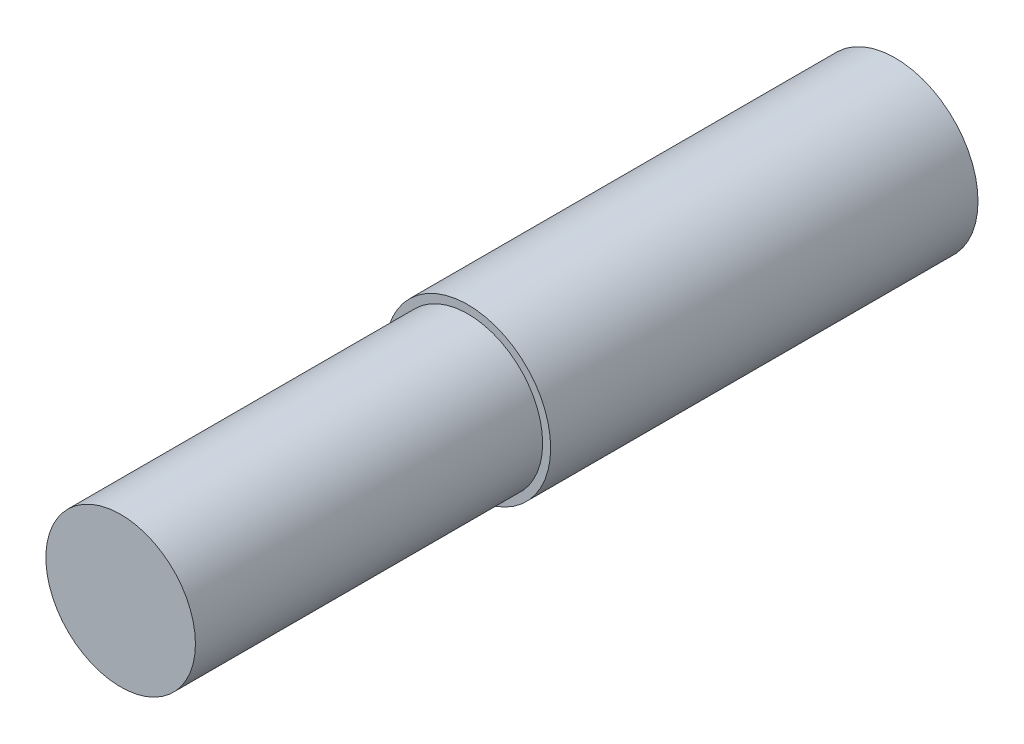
ISO-10303-21;
HEADER;
FILE_DESCRIPTION(('STEP AP214'),'2;1');
FILE_NAME('part.step','',(''),(''),'','','');
FILE_SCHEMA(('AUTOMOTIVE_DESIGN { 1 0 10303 214 1 1 1 1 }'));
ENDSEC;
DATA;
#1=APPLICATION_CONTEXT('core data for automotive mechanical design processes');
#2=APPLICATION_PROTOCOL_DEFINITION('international standard','automotive_design',2000,#1);
#3=PRODUCT_CONTEXT('',#1,'mechanical');
#4=PRODUCT('Part','Part','',(#3));
#5=PRODUCT_RELATED_PRODUCT_CATEGORY('part','',(#4));
#6=PRODUCT_DEFINITION_FORMATION('','',#4);
#7=PRODUCT_DEFINITION_CONTEXT('part definition',#1,'design');
#8=PRODUCT_DEFINITION('design','',#6,#7);
#9=PRODUCT_DEFINITION_SHAPE('','',#8);
#10=(LENGTH_UNIT() NAMED_UNIT(*) SI_UNIT(.MILLI.,.METRE.));
#11=(NAMED_UNIT(*) PLANE_ANGLE_UNIT() SI_UNIT($,.RADIAN.));
#12=(NAMED_UNIT(*) SI_UNIT($,.STERADIAN.) SOLID_ANGLE_UNIT());
#13=UNCERTAINTY_MEASURE_WITH_UNIT(LENGTH_MEASURE(1.E-05),#10,'distance_accuracy_value','');
#14=(GEOMETRIC_REPRESENTATION_CONTEXT(3) GLOBAL_UNCERTAINTY_ASSIGNED_CONTEXT((#13)) GLOBAL_UNIT_ASSIGNED_CONTEXT((#10,
#11,#12)) REPRESENTATION_CONTEXT('',''));
#15=CARTESIAN_POINT('',(0.,0.,0.));
#16=DIRECTION('',(0.,0.,1.));
#17=DIRECTION('',(1.,0.,0.));
#18=AXIS2_PLACEMENT_3D('',#15,#16,#17);
#19=CARTESIAN_POINT('',(0.,0.,80.));
#20=DIRECTION('',(0.,0.,-1.));
#21=DIRECTION('',(-1.,0.,0.));
#22=AXIS2_PLACEMENT_3D('',#19,#20,#21);
#23=CYLINDRICAL_SURFACE('',#22,15.5);
#24=CARTESIAN_POINT('',(0.,0.,80.));
#25=DIRECTION('',(0.,0.,1.));
#26=DIRECTION('',(1.,0.,0.));
#27=AXIS2_PLACEMENT_3D('',#24,#25,#26);
#28=CIRCLE('',#27,15.5);
#29=CARTESIAN_POINT('',(15.5,0.,80.));
#30=VERTEX_POINT('',#29);
#31=EDGE_CURVE('E10',#30,#30,#28,.T.);
#32=ORIENTED_EDGE('',*,*,#31,.F.);
#33=EDGE_LOOP('',(#32));
#34=FACE_BOUND('',#33,.T.);
#35=CARTESIAN_POINT('',(0.,0.,0.));
#36=DIRECTION('',(0.,0.,1.));
#37=DIRECTION('',(1.,0.,0.));
#38=AXIS2_PLACEMENT_3D('',#35,#36,#37);
#39=CIRCLE('',#38,15.5);
#40=CARTESIAN_POINT('',(15.5,0.,0.));
#41=VERTEX_POINT('',#40);
#42=EDGE_CURVE('E34',#41,#41,#39,.T.);
#43=ORIENTED_EDGE('',*,*,#42,.T.);
#44=EDGE_LOOP('',(#43));
#45=FACE_BOUND('',#44,.T.);
#46=ADVANCED_FACE('F31',(#34,#45),#23,.T.);
#47=CARTESIAN_POINT('',(0.,0.,80.));
#48=DIRECTION('',(0.,0.,1.));
#49=DIRECTION('',(1.,0.,0.));
#50=AXIS2_PLACEMENT_3D('',#47,#48,#49);
#51=PLANE('',#50);
#52=CARTESIAN_POINT('',(0.,0.,80.));
#53=DIRECTION('',(0.,0.,1.));
#54=DIRECTION('',(1.,0.,0.));
#55=AXIS2_PLACEMENT_3D('',#52,#53,#54);
#56=CIRCLE('',#55,14.);
#57=CARTESIAN_POINT('',(14.,0.,80.));
#58=VERTEX_POINT('',#57);
#59=EDGE_CURVE('E43',#58,#58,#56,.T.);
#60=ORIENTED_EDGE('',*,*,#59,.F.);
#61=EDGE_LOOP('',(#60));
#62=FACE_BOUND('',#61,.T.);
#63=ORIENTED_EDGE('',*,*,#31,.T.);
#64=EDGE_LOOP('',(#63));
#65=FACE_BOUND('',#64,.T.);
#66=ADVANCED_FACE('F58',(#62,#65),#51,.T.);
#67=CARTESIAN_POINT('',(0.,0.,0.));
#68=DIRECTION('',(0.,0.,1.));
#69=DIRECTION('',(1.,0.,0.));
#70=AXIS2_PLACEMENT_3D('',#67,#68,#69);
#71=PLANE('',#70);
#72=ORIENTED_EDGE('',*,*,#42,.F.);
#73=EDGE_LOOP('',(#72));
#74=FACE_BOUND('',#73,.T.);
#75=ADVANCED_FACE('F54',(#74),#71,.F.);
#76=CARTESIAN_POINT('',(0.,0.,145.));
#77=DIRECTION('',(0.,0.,-1.));
#78=DIRECTION('',(-1.,0.,0.));
#79=AXIS2_PLACEMENT_3D('',#76,#77,#78);
#80=CYLINDRICAL_SURFACE('',#79,14.);
#81=CARTESIAN_POINT('',(0.,0.,145.));
#82=DIRECTION('',(0.,0.,1.));
#83=DIRECTION('',(1.,0.,0.));
#84=AXIS2_PLACEMENT_3D('',#81,#82,#83);
#85=CIRCLE('',#84,14.);
#86=CARTESIAN_POINT('',(14.,0.,145.));
#87=VERTEX_POINT('',#86);
#88=EDGE_CURVE('E41',#87,#87,#85,.T.);
#89=ORIENTED_EDGE('',*,*,#88,.F.);
#90=EDGE_LOOP('',(#89));
#91=FACE_BOUND('',#90,.T.);
#92=ORIENTED_EDGE('',*,*,#59,.T.);
#93=EDGE_LOOP('',(#92));
#94=FACE_BOUND('',#93,.T.);
#95=ADVANCED_FACE('F51',(#91,#94),#80,.T.);
#96=CARTESIAN_POINT('',(0.,0.,145.));
#97=DIRECTION('',(0.,0.,1.));
#98=DIRECTION('',(1.,0.,0.));
#99=AXIS2_PLACEMENT_3D('',#96,#97,#98);
#100=PLANE('',#99);
#101=ORIENTED_EDGE('',*,*,#88,.T.);
#102=EDGE_LOOP('',(#101));
#103=FACE_BOUND('',#102,.T.);
#104=ADVANCED_FACE('F49',(#103),#100,.T.);
#105=CLOSED_SHELL('',(#46,#66,#75,#95,#104));
#106=MANIFOLD_SOLID_BREP('B2',#105);
#107=ADVANCED_BREP_SHAPE_REPRESENTATION('',(#18,#106),#14);
#108=SHAPE_DEFINITION_REPRESENTATION(#9,#107);
ENDSEC;
END-ISO-10303-21;
